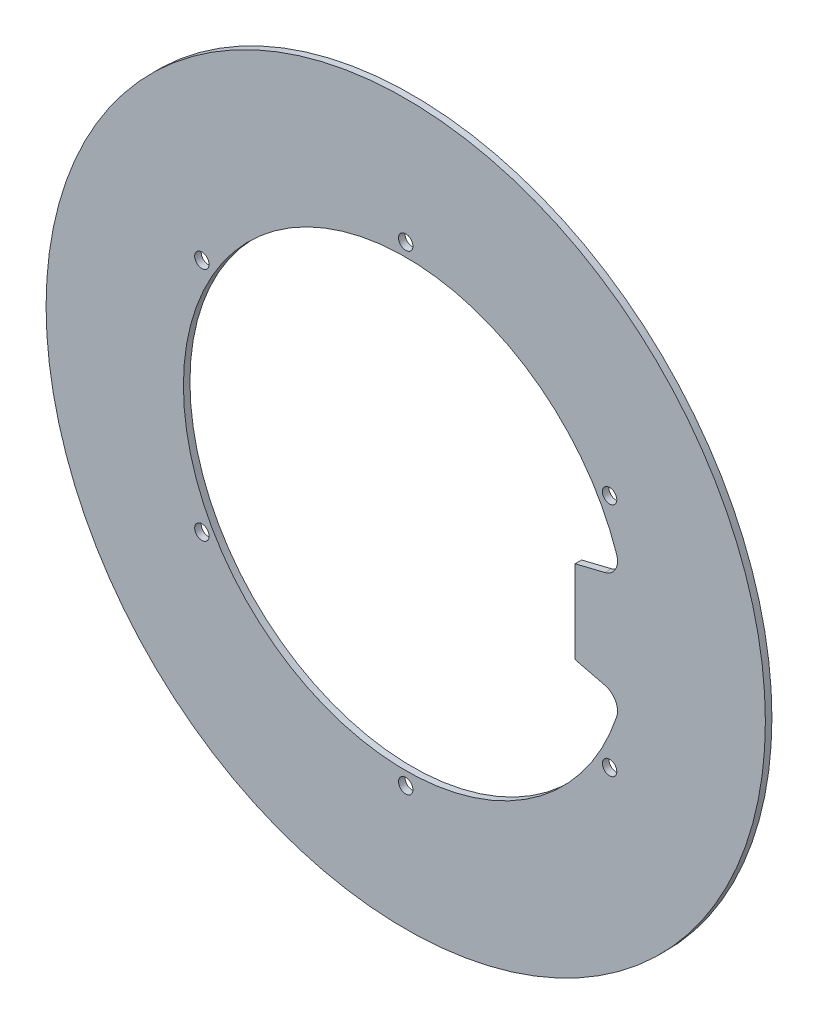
ISO-10303-21;
HEADER;
FILE_DESCRIPTION(('STEP AP214'),'2;1');
FILE_NAME('part.step','',(''),(''),'','','');
FILE_SCHEMA(('AUTOMOTIVE_DESIGN { 1 0 10303 214 1 1 1 1 }'));
ENDSEC;
DATA;
#1=APPLICATION_CONTEXT('core data for automotive mechanical design processes');
#2=APPLICATION_PROTOCOL_DEFINITION('international standard','automotive_design',2000,#1);
#3=PRODUCT_CONTEXT('',#1,'mechanical');
#4=PRODUCT('Part','Part','',(#3));
#5=PRODUCT_RELATED_PRODUCT_CATEGORY('part','',(#4));
#6=PRODUCT_DEFINITION_FORMATION('','',#4);
#7=PRODUCT_DEFINITION_CONTEXT('part definition',#1,'design');
#8=PRODUCT_DEFINITION('design','',#6,#7);
#9=PRODUCT_DEFINITION_SHAPE('','',#8);
#10=(LENGTH_UNIT() NAMED_UNIT(*) SI_UNIT(.MILLI.,.METRE.));
#11=(NAMED_UNIT(*) PLANE_ANGLE_UNIT() SI_UNIT($,.RADIAN.));
#12=(NAMED_UNIT(*) SI_UNIT($,.STERADIAN.) SOLID_ANGLE_UNIT());
#13=UNCERTAINTY_MEASURE_WITH_UNIT(LENGTH_MEASURE(1.E-05),#10,'distance_accuracy_value','');
#14=(GEOMETRIC_REPRESENTATION_CONTEXT(3) GLOBAL_UNCERTAINTY_ASSIGNED_CONTEXT((#13)) GLOBAL_UNIT_ASSIGNED_CONTEXT((#10,
#11,#12)) REPRESENTATION_CONTEXT('',''));
#15=CARTESIAN_POINT('',(0.,0.,0.));
#16=DIRECTION('',(0.,0.,1.));
#17=DIRECTION('',(1.,0.,0.));
#18=AXIS2_PLACEMENT_3D('',#15,#16,#17);
#19=CARTESIAN_POINT('',(0.,0.,1.));
#20=DIRECTION('',(0.,0.,1.));
#21=DIRECTION('',(1.,0.,0.));
#22=AXIS2_PLACEMENT_3D('',#19,#20,#21);
#23=PLANE('',#22);
#24=CARTESIAN_POINT('',(-31.1769145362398,-18.,1.));
#25=DIRECTION('',(0.,0.,1.));
#26=DIRECTION('',(1.,0.,0.));
#27=AXIS2_PLACEMENT_3D('',#24,#25,#26);
#28=CIRCLE('',#27,1.10000000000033);
#29=CARTESIAN_POINT('',(-30.0769145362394,-18.,1.));
#30=VERTEX_POINT('',#29);
#31=EDGE_CURVE('E143',#30,#30,#28,.T.);
#32=ORIENTED_EDGE('',*,*,#31,.F.);
#33=EDGE_LOOP('',(#32));
#34=FACE_BOUND('',#33,.T.);
#35=CARTESIAN_POINT('',(31.1769145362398,-18.,1.));
#36=DIRECTION('',(0.,0.,1.));
#37=DIRECTION('',(1.,0.,0.));
#38=AXIS2_PLACEMENT_3D('',#35,#36,#37);
#39=CIRCLE('',#38,1.10000000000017);
#40=CARTESIAN_POINT('',(32.27691453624,-18.,1.));
#41=VERTEX_POINT('',#40);
#42=EDGE_CURVE('E155',#41,#41,#39,.T.);
#43=ORIENTED_EDGE('',*,*,#42,.F.);
#44=EDGE_LOOP('',(#43));
#45=FACE_BOUND('',#44,.T.);
#46=CARTESIAN_POINT('',(0.,36.,1.));
#47=DIRECTION('',(0.,0.,1.));
#48=DIRECTION('',(1.,0.,0.));
#49=AXIS2_PLACEMENT_3D('',#46,#47,#48);
#50=CIRCLE('',#49,1.1);
#51=CARTESIAN_POINT('',(1.1,36.,1.));
#52=VERTEX_POINT('',#51);
#53=EDGE_CURVE('E167',#52,#52,#50,.T.);
#54=ORIENTED_EDGE('',*,*,#53,.F.);
#55=EDGE_LOOP('',(#54));
#56=FACE_BOUND('',#55,.T.);
#57=CARTESIAN_POINT('',(0.,0.,1.));
#58=DIRECTION('',(0.,0.,1.));
#59=DIRECTION('',(1.,0.,0.));
#60=AXIS2_PLACEMENT_3D('',#57,#58,#59);
#61=CIRCLE('',#60,55.);
#62=CARTESIAN_POINT('',(55.,0.,1.));
#63=VERTEX_POINT('',#62);
#64=EDGE_CURVE('E11',#63,#63,#61,.T.);
#65=ORIENTED_EDGE('',*,*,#64,.T.);
#66=EDGE_LOOP('',(#65));
#67=FACE_BOUND('',#66,.T.);
#68=CARTESIAN_POINT('',(31.1769145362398,17.9999999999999,1.));
#69=DIRECTION('',(0.,0.,1.));
#70=DIRECTION('',(1.,0.,0.));
#71=AXIS2_PLACEMENT_3D('',#68,#69,#70);
#72=CIRCLE('',#71,1.09999999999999);
#73=CARTESIAN_POINT('',(32.2769145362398,17.9999999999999,1.));
#74=VERTEX_POINT('',#73);
#75=EDGE_CURVE('E161',#74,#74,#72,.T.);
#76=ORIENTED_EDGE('',*,*,#75,.F.);
#77=EDGE_LOOP('',(#76));
#78=FACE_BOUND('',#77,.T.);
#79=CARTESIAN_POINT('',(0.,-36.,1.));
#80=DIRECTION('',(0.,0.,1.));
#81=DIRECTION('',(1.,0.,0.));
#82=AXIS2_PLACEMENT_3D('',#79,#80,#81);
#83=CIRCLE('',#82,1.10000000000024);
#84=CARTESIAN_POINT('',(1.10000000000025,-36.,1.));
#85=VERTEX_POINT('',#84);
#86=EDGE_CURVE('E149',#85,#85,#83,.T.);
#87=ORIENTED_EDGE('',*,*,#86,.F.);
#88=EDGE_LOOP('',(#87));
#89=FACE_BOUND('',#88,.T.);
#90=CARTESIAN_POINT('',(-31.1769145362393,17.9999999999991,1.));
#91=DIRECTION('',(0.,0.,1.));
#92=DIRECTION('',(1.,0.,0.));
#93=AXIS2_PLACEMENT_3D('',#90,#91,#92);
#94=CIRCLE('',#93,1.10000000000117);
#95=CARTESIAN_POINT('',(-30.0769145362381,17.9999999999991,1.));
#96=VERTEX_POINT('',#95);
#97=EDGE_CURVE('E137',#96,#96,#94,.T.);
#98=ORIENTED_EDGE('',*,*,#97,.F.);
#99=EDGE_LOOP('',(#98));
#100=FACE_BOUND('',#99,.T.);
#101=DIRECTION('',(0.971252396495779,0.238052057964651,0.));
#102=VECTOR('',#101,1.);
#103=CARTESIAN_POINT('',(25.908,6.35,1.));
#104=LINE('',#103,#102);
#105=CARTESIAN_POINT('',(25.908,6.35,1.));
#106=VERTEX_POINT('',#105);
#107=CARTESIAN_POINT('',(30.4558486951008,7.46466879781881,1.));
#108=VERTEX_POINT('',#107);
#109=EDGE_CURVE('E94',#106,#108,#104,.T.);
#110=ORIENTED_EDGE('',*,*,#109,.F.);
#111=DIRECTION('',(0.,1.,0.));
#112=VECTOR('',#111,1.);
#113=CARTESIAN_POINT('',(25.908,-6.35,1.));
#114=LINE('',#113,#112);
#115=CARTESIAN_POINT('',(25.908,-6.35,1.));
#116=VERTEX_POINT('',#115);
#117=EDGE_CURVE('E86',#116,#106,#114,.T.);
#118=ORIENTED_EDGE('',*,*,#117,.F.);
#119=DIRECTION('',(-0.971252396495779,0.238052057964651,0.));
#120=VECTOR('',#119,1.);
#121=CARTESIAN_POINT('',(25.908,-6.35,1.));
#122=LINE('',#121,#120);
#123=CARTESIAN_POINT('',(30.4558486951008,-7.46466879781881,1.));
#124=VERTEX_POINT('',#123);
#125=EDGE_CURVE('E115',#124,#116,#122,.T.);
#126=ORIENTED_EDGE('',*,*,#125,.F.);
#127=CARTESIAN_POINT('',(29.8511964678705,-9.93164988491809,1.));
#128=DIRECTION('',(0.,0.,1.));
#129=DIRECTION('',(-1.,0.,0.));
#130=AXIS2_PLACEMENT_3D('',#127,#128,#129);
#131=CIRCLE('',#130,2.54);
#132=CARTESIAN_POINT('',(32.2613057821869,-10.7335059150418,1.));
#133=VERTEX_POINT('',#132);
#134=EDGE_CURVE('E113',#133,#124,#131,.T.);
#135=ORIENTED_EDGE('',*,*,#134,.F.);
#136=CARTESIAN_POINT('',(0.,0.,1.));
#137=DIRECTION('',(0.,0.,1.));
#138=DIRECTION('',(1.,0.,0.));
#139=AXIS2_PLACEMENT_3D('',#136,#137,#138);
#140=CIRCLE('',#139,34.);
#141=CARTESIAN_POINT('',(32.2613057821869,10.7335059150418,1.));
#142=VERTEX_POINT('',#141);
#143=EDGE_CURVE('E109',#142,#133,#140,.T.);
#144=ORIENTED_EDGE('',*,*,#143,.F.);
#145=CARTESIAN_POINT('',(29.8511964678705,9.93164988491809,1.));
#146=DIRECTION('',(0.,0.,1.));
#147=DIRECTION('',(1.,0.,0.));
#148=AXIS2_PLACEMENT_3D('',#145,#146,#147);
#149=CIRCLE('',#148,2.54);
#150=EDGE_CURVE('E107',#108,#142,#149,.T.);
#151=ORIENTED_EDGE('',*,*,#150,.F.);
#152=EDGE_LOOP('',(#110,#118,#126,#135,#144,#151));
#153=FACE_BOUND('',#152,.T.);
#154=ADVANCED_FACE('F33',(#34,#45,#56,#67,#78,#89,#100,#153),#23,.T.);
#155=CARTESIAN_POINT('',(0.,0.,0.));
#156=DIRECTION('',(0.,0.,1.));
#157=DIRECTION('',(1.,0.,0.));
#158=AXIS2_PLACEMENT_3D('',#155,#156,#157);
#159=PLANE('',#158);
#160=CARTESIAN_POINT('',(-31.1769145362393,17.9999999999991,0.));
#161=DIRECTION('',(0.,0.,1.));
#162=DIRECTION('',(1.,0.,0.));
#163=AXIS2_PLACEMENT_3D('',#160,#161,#162);
#164=CIRCLE('',#163,1.10000000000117);
#165=CARTESIAN_POINT('',(-30.0769145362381,17.9999999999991,0.));
#166=VERTEX_POINT('',#165);
#167=EDGE_CURVE('E102',#166,#166,#164,.T.);
#168=ORIENTED_EDGE('',*,*,#167,.T.);
#169=EDGE_LOOP('',(#168));
#170=FACE_BOUND('',#169,.T.);
#171=CARTESIAN_POINT('',(-31.1769145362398,-18.,0.));
#172=DIRECTION('',(0.,0.,1.));
#173=DIRECTION('',(1.,0.,0.));
#174=AXIS2_PLACEMENT_3D('',#171,#172,#173);
#175=CIRCLE('',#174,1.10000000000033);
#176=CARTESIAN_POINT('',(-30.0769145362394,-18.,0.));
#177=VERTEX_POINT('',#176);
#178=EDGE_CURVE('E140',#177,#177,#175,.T.);
#179=ORIENTED_EDGE('',*,*,#178,.T.);
#180=EDGE_LOOP('',(#179));
#181=FACE_BOUND('',#180,.T.);
#182=CARTESIAN_POINT('',(0.,-36.,0.));
#183=DIRECTION('',(0.,0.,1.));
#184=DIRECTION('',(1.,0.,0.));
#185=AXIS2_PLACEMENT_3D('',#182,#183,#184);
#186=CIRCLE('',#185,1.10000000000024);
#187=CARTESIAN_POINT('',(1.10000000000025,-36.,0.));
#188=VERTEX_POINT('',#187);
#189=EDGE_CURVE('E146',#188,#188,#186,.T.);
#190=ORIENTED_EDGE('',*,*,#189,.T.);
#191=EDGE_LOOP('',(#190));
#192=FACE_BOUND('',#191,.T.);
#193=CARTESIAN_POINT('',(31.1769145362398,-18.,0.));
#194=DIRECTION('',(0.,0.,1.));
#195=DIRECTION('',(1.,0.,0.));
#196=AXIS2_PLACEMENT_3D('',#193,#194,#195);
#197=CIRCLE('',#196,1.10000000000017);
#198=CARTESIAN_POINT('',(32.27691453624,-18.,0.));
#199=VERTEX_POINT('',#198);
#200=EDGE_CURVE('E152',#199,#199,#197,.T.);
#201=ORIENTED_EDGE('',*,*,#200,.T.);
#202=EDGE_LOOP('',(#201));
#203=FACE_BOUND('',#202,.T.);
#204=CARTESIAN_POINT('',(31.1769145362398,17.9999999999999,0.));
#205=DIRECTION('',(0.,0.,1.));
#206=DIRECTION('',(1.,0.,0.));
#207=AXIS2_PLACEMENT_3D('',#204,#205,#206);
#208=CIRCLE('',#207,1.09999999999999);
#209=CARTESIAN_POINT('',(32.2769145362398,17.9999999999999,0.));
#210=VERTEX_POINT('',#209);
#211=EDGE_CURVE('E158',#210,#210,#208,.T.);
#212=ORIENTED_EDGE('',*,*,#211,.T.);
#213=EDGE_LOOP('',(#212));
#214=FACE_BOUND('',#213,.T.);
#215=CARTESIAN_POINT('',(0.,36.,0.));
#216=DIRECTION('',(0.,0.,1.));
#217=DIRECTION('',(1.,0.,0.));
#218=AXIS2_PLACEMENT_3D('',#215,#216,#217);
#219=CIRCLE('',#218,1.1);
#220=CARTESIAN_POINT('',(1.1,36.,0.));
#221=VERTEX_POINT('',#220);
#222=EDGE_CURVE('E164',#221,#221,#219,.T.);
#223=ORIENTED_EDGE('',*,*,#222,.T.);
#224=EDGE_LOOP('',(#223));
#225=FACE_BOUND('',#224,.T.);
#226=CARTESIAN_POINT('',(0.,0.,0.));
#227=DIRECTION('',(0.,0.,1.));
#228=DIRECTION('',(1.,0.,0.));
#229=AXIS2_PLACEMENT_3D('',#226,#227,#228);
#230=CIRCLE('',#229,55.);
#231=CARTESIAN_POINT('',(55.,0.,0.));
#232=VERTEX_POINT('',#231);
#233=EDGE_CURVE('E37',#232,#232,#230,.T.);
#234=ORIENTED_EDGE('',*,*,#233,.F.);
#235=EDGE_LOOP('',(#234));
#236=FACE_BOUND('',#235,.T.);
#237=DIRECTION('',(0.,1.,0.));
#238=VECTOR('',#237,1.);
#239=CARTESIAN_POINT('',(25.908,-6.35,0.));
#240=LINE('',#239,#238);
#241=CARTESIAN_POINT('',(25.908,-6.35,0.));
#242=VERTEX_POINT('',#241);
#243=CARTESIAN_POINT('',(25.908,6.35,0.));
#244=VERTEX_POINT('',#243);
#245=EDGE_CURVE('E56',#242,#244,#240,.T.);
#246=ORIENTED_EDGE('',*,*,#245,.T.);
#247=DIRECTION('',(0.971252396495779,0.238052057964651,0.));
#248=VECTOR('',#247,1.);
#249=CARTESIAN_POINT('',(25.908,6.35,0.));
#250=LINE('',#249,#248);
#251=CARTESIAN_POINT('',(30.4558486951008,7.46466879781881,0.));
#252=VERTEX_POINT('',#251);
#253=EDGE_CURVE('E101',#244,#252,#250,.T.);
#254=ORIENTED_EDGE('',*,*,#253,.T.);
#255=CARTESIAN_POINT('',(29.8511964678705,9.93164988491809,0.));
#256=DIRECTION('',(0.,0.,1.));
#257=DIRECTION('',(1.,0.,0.));
#258=AXIS2_PLACEMENT_3D('',#255,#256,#257);
#259=CIRCLE('',#258,2.54);
#260=CARTESIAN_POINT('',(32.2613057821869,10.7335059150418,0.));
#261=VERTEX_POINT('',#260);
#262=EDGE_CURVE('E119',#252,#261,#259,.T.);
#263=ORIENTED_EDGE('',*,*,#262,.T.);
#264=CARTESIAN_POINT('',(0.,0.,0.));
#265=DIRECTION('',(0.,0.,1.));
#266=DIRECTION('',(1.,0.,0.));
#267=AXIS2_PLACEMENT_3D('',#264,#265,#266);
#268=CIRCLE('',#267,34.);
#269=CARTESIAN_POINT('',(32.2613057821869,-10.7335059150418,0.));
#270=VERTEX_POINT('',#269);
#271=EDGE_CURVE('E122',#261,#270,#268,.T.);
#272=ORIENTED_EDGE('',*,*,#271,.T.);
#273=CARTESIAN_POINT('',(29.8511964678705,-9.93164988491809,0.));
#274=DIRECTION('',(0.,0.,1.));
#275=DIRECTION('',(-1.,0.,0.));
#276=AXIS2_PLACEMENT_3D('',#273,#274,#275);
#277=CIRCLE('',#276,2.54);
#278=CARTESIAN_POINT('',(30.4558486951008,-7.46466879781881,0.));
#279=VERTEX_POINT('',#278);
#280=EDGE_CURVE('E125',#270,#279,#277,.T.);
#281=ORIENTED_EDGE('',*,*,#280,.T.);
#282=DIRECTION('',(-0.971252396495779,0.238052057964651,0.));
#283=VECTOR('',#282,1.);
#284=CARTESIAN_POINT('',(25.908,-6.35,0.));
#285=LINE('',#284,#283);
#286=EDGE_CURVE('E95',#279,#242,#285,.T.);
#287=ORIENTED_EDGE('',*,*,#286,.T.);
#288=EDGE_LOOP('',(#246,#254,#263,#272,#281,#287));
#289=FACE_BOUND('',#288,.T.);
#290=ADVANCED_FACE('F173',(#170,#181,#192,#203,#214,#225,#236,#289),#159,.F.);
#291=CARTESIAN_POINT('',(0.,0.,1.));
#292=DIRECTION('',(0.,0.,-1.));
#293=DIRECTION('',(-1.,0.,0.));
#294=AXIS2_PLACEMENT_3D('',#291,#292,#293);
#295=CYLINDRICAL_SURFACE('',#294,55.);
#296=ORIENTED_EDGE('',*,*,#64,.F.);
#297=EDGE_LOOP('',(#296));
#298=FACE_BOUND('',#297,.T.);
#299=ORIENTED_EDGE('',*,*,#233,.T.);
#300=EDGE_LOOP('',(#299));
#301=FACE_BOUND('',#300,.T.);
#302=ADVANCED_FACE('F35',(#298,#301),#295,.T.);
#303=CARTESIAN_POINT('',(0.,36.,1.));
#304=DIRECTION('',(0.,0.,-1.));
#305=DIRECTION('',(-1.,0.,0.));
#306=AXIS2_PLACEMENT_3D('',#303,#304,#305);
#307=CYLINDRICAL_SURFACE('',#306,1.1);
#308=ORIENTED_EDGE('',*,*,#53,.T.);
#309=EDGE_LOOP('',(#308));
#310=FACE_BOUND('',#309,.T.);
#311=ORIENTED_EDGE('',*,*,#222,.F.);
#312=EDGE_LOOP('',(#311));
#313=FACE_BOUND('',#312,.T.);
#314=ADVANCED_FACE('F176',(#310,#313),#307,.F.);
#315=CARTESIAN_POINT('',(31.1769145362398,17.9999999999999,1.));
#316=DIRECTION('',(0.,0.,-1.));
#317=DIRECTION('',(-1.,0.,0.));
#318=AXIS2_PLACEMENT_3D('',#315,#316,#317);
#319=CYLINDRICAL_SURFACE('',#318,1.09999999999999);
#320=ORIENTED_EDGE('',*,*,#75,.T.);
#321=EDGE_LOOP('',(#320));
#322=FACE_BOUND('',#321,.T.);
#323=ORIENTED_EDGE('',*,*,#211,.F.);
#324=EDGE_LOOP('',(#323));
#325=FACE_BOUND('',#324,.T.);
#326=ADVANCED_FACE('F178',(#322,#325),#319,.F.);
#327=CARTESIAN_POINT('',(31.1769145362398,-18.,1.));
#328=DIRECTION('',(0.,0.,-1.));
#329=DIRECTION('',(-1.,0.,0.));
#330=AXIS2_PLACEMENT_3D('',#327,#328,#329);
#331=CYLINDRICAL_SURFACE('',#330,1.10000000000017);
#332=ORIENTED_EDGE('',*,*,#42,.T.);
#333=EDGE_LOOP('',(#332));
#334=FACE_BOUND('',#333,.T.);
#335=ORIENTED_EDGE('',*,*,#200,.F.);
#336=EDGE_LOOP('',(#335));
#337=FACE_BOUND('',#336,.T.);
#338=ADVANCED_FACE('F185',(#334,#337),#331,.F.);
#339=CARTESIAN_POINT('',(0.,-36.,1.));
#340=DIRECTION('',(0.,0.,-1.));
#341=DIRECTION('',(-1.,0.,0.));
#342=AXIS2_PLACEMENT_3D('',#339,#340,#341);
#343=CYLINDRICAL_SURFACE('',#342,1.10000000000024);
#344=ORIENTED_EDGE('',*,*,#86,.T.);
#345=EDGE_LOOP('',(#344));
#346=FACE_BOUND('',#345,.T.);
#347=ORIENTED_EDGE('',*,*,#189,.F.);
#348=EDGE_LOOP('',(#347));
#349=FACE_BOUND('',#348,.T.);
#350=ADVANCED_FACE('F227',(#346,#349),#343,.F.);
#351=CARTESIAN_POINT('',(-31.1769145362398,-18.,1.));
#352=DIRECTION('',(0.,0.,-1.));
#353=DIRECTION('',(-1.,0.,0.));
#354=AXIS2_PLACEMENT_3D('',#351,#352,#353);
#355=CYLINDRICAL_SURFACE('',#354,1.10000000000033);
#356=ORIENTED_EDGE('',*,*,#31,.T.);
#357=EDGE_LOOP('',(#356));
#358=FACE_BOUND('',#357,.T.);
#359=ORIENTED_EDGE('',*,*,#178,.F.);
#360=EDGE_LOOP('',(#359));
#361=FACE_BOUND('',#360,.T.);
#362=ADVANCED_FACE('F213',(#358,#361),#355,.F.);
#363=CARTESIAN_POINT('',(-31.1769145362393,17.9999999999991,1.));
#364=DIRECTION('',(0.,0.,-1.));
#365=DIRECTION('',(-1.,0.,0.));
#366=AXIS2_PLACEMENT_3D('',#363,#364,#365);
#367=CYLINDRICAL_SURFACE('',#366,1.10000000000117);
#368=ORIENTED_EDGE('',*,*,#97,.T.);
#369=EDGE_LOOP('',(#368));
#370=FACE_BOUND('',#369,.T.);
#371=ORIENTED_EDGE('',*,*,#167,.F.);
#372=EDGE_LOOP('',(#371));
#373=FACE_BOUND('',#372,.T.);
#374=ADVANCED_FACE('F210',(#370,#373),#367,.F.);
#375=CARTESIAN_POINT('',(25.908,-6.35,1.));
#376=DIRECTION('',(-1.,0.,0.));
#377=DIRECTION('',(0.,0.,1.));
#378=AXIS2_PLACEMENT_3D('',#375,#376,#377);
#379=PLANE('',#378);
#380=ORIENTED_EDGE('',*,*,#245,.F.);
#381=DIRECTION('',(0.,0.,-1.));
#382=VECTOR('',#381,1.);
#383=CARTESIAN_POINT('',(25.908,-6.35,1.));
#384=LINE('',#383,#382);
#385=EDGE_CURVE('E90',#116,#242,#384,.T.);
#386=ORIENTED_EDGE('',*,*,#385,.F.);
#387=ORIENTED_EDGE('',*,*,#117,.T.);
#388=DIRECTION('',(0.,0.,-1.));
#389=VECTOR('',#388,1.);
#390=CARTESIAN_POINT('',(25.908,6.35,1.));
#391=LINE('',#390,#389);
#392=EDGE_CURVE('E89',#106,#244,#391,.T.);
#393=ORIENTED_EDGE('',*,*,#392,.T.);
#394=EDGE_LOOP('',(#380,#386,#387,#393));
#395=FACE_BOUND('',#394,.T.);
#396=ADVANCED_FACE('F88',(#395),#379,.T.);
#397=CARTESIAN_POINT('',(25.908,6.35,1.));
#398=DIRECTION('',(-0.238052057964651,0.971252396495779,0.));
#399=DIRECTION('',(-0.971252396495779,-0.238052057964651,0.));
#400=AXIS2_PLACEMENT_3D('',#397,#398,#399);
#401=PLANE('',#400);
#402=ORIENTED_EDGE('',*,*,#253,.F.);
#403=ORIENTED_EDGE('',*,*,#392,.F.);
#404=ORIENTED_EDGE('',*,*,#109,.T.);
#405=DIRECTION('',(0.,0.,-1.));
#406=VECTOR('',#405,1.);
#407=CARTESIAN_POINT('',(30.4558486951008,7.46466879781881,1.));
#408=LINE('',#407,#406);
#409=EDGE_CURVE('E103',#108,#252,#408,.T.);
#410=ORIENTED_EDGE('',*,*,#409,.T.);
#411=EDGE_LOOP('',(#402,#403,#404,#410));
#412=FACE_BOUND('',#411,.T.);
#413=ADVANCED_FACE('F98',(#412),#401,.T.);
#414=CARTESIAN_POINT('',(29.8511964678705,9.93164988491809,1.));
#415=DIRECTION('',(0.,0.,-1.));
#416=DIRECTION('',(-1.,0.,0.));
#417=AXIS2_PLACEMENT_3D('',#414,#415,#416);
#418=CYLINDRICAL_SURFACE('',#417,2.54);
#419=ORIENTED_EDGE('',*,*,#262,.F.);
#420=ORIENTED_EDGE('',*,*,#409,.F.);
#421=ORIENTED_EDGE('',*,*,#150,.T.);
#422=DIRECTION('',(0.,0.,-1.));
#423=VECTOR('',#422,1.);
#424=CARTESIAN_POINT('',(32.2613057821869,10.7335059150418,1.));
#425=LINE('',#424,#423);
#426=EDGE_CURVE('E134',#142,#261,#425,.T.);
#427=ORIENTED_EDGE('',*,*,#426,.T.);
#428=EDGE_LOOP('',(#419,#420,#421,#427));
#429=FACE_BOUND('',#428,.T.);
#430=ADVANCED_FACE('F243',(#429),#418,.F.);
#431=CARTESIAN_POINT('',(0.,0.,1.));
#432=DIRECTION('',(0.,0.,-1.));
#433=DIRECTION('',(-1.,0.,0.));
#434=AXIS2_PLACEMENT_3D('',#431,#432,#433);
#435=CYLINDRICAL_SURFACE('',#434,34.);
#436=ORIENTED_EDGE('',*,*,#271,.F.);
#437=ORIENTED_EDGE('',*,*,#426,.F.);
#438=ORIENTED_EDGE('',*,*,#143,.T.);
#439=DIRECTION('',(0.,0.,-1.));
#440=VECTOR('',#439,1.);
#441=CARTESIAN_POINT('',(32.2613057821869,-10.7335059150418,1.));
#442=LINE('',#441,#440);
#443=EDGE_CURVE('E132',#133,#270,#442,.T.);
#444=ORIENTED_EDGE('',*,*,#443,.T.);
#445=EDGE_LOOP('',(#436,#437,#438,#444));
#446=FACE_BOUND('',#445,.T.);
#447=ADVANCED_FACE('F246',(#446),#435,.F.);
#448=CARTESIAN_POINT('',(29.8511964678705,-9.93164988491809,1.));
#449=DIRECTION('',(0.,0.,-1.));
#450=DIRECTION('',(-1.,0.,0.));
#451=AXIS2_PLACEMENT_3D('',#448,#449,#450);
#452=CYLINDRICAL_SURFACE('',#451,2.54);
#453=ORIENTED_EDGE('',*,*,#280,.F.);
#454=ORIENTED_EDGE('',*,*,#443,.F.);
#455=ORIENTED_EDGE('',*,*,#134,.T.);
#456=DIRECTION('',(0.,0.,-1.));
#457=VECTOR('',#456,1.);
#458=CARTESIAN_POINT('',(30.4558486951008,-7.46466879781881,1.));
#459=LINE('',#458,#457);
#460=EDGE_CURVE('E48',#124,#279,#459,.T.);
#461=ORIENTED_EDGE('',*,*,#460,.T.);
#462=EDGE_LOOP('',(#453,#454,#455,#461));
#463=FACE_BOUND('',#462,.T.);
#464=ADVANCED_FACE('F250',(#463),#452,.F.);
#465=CARTESIAN_POINT('',(25.908,-6.35,1.));
#466=DIRECTION('',(-0.238052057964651,-0.971252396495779,0.));
#467=DIRECTION('',(0.971252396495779,-0.238052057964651,0.));
#468=AXIS2_PLACEMENT_3D('',#465,#466,#467);
#469=PLANE('',#468);
#470=ORIENTED_EDGE('',*,*,#286,.F.);
#471=ORIENTED_EDGE('',*,*,#460,.F.);
#472=ORIENTED_EDGE('',*,*,#125,.T.);
#473=ORIENTED_EDGE('',*,*,#385,.T.);
#474=EDGE_LOOP('',(#470,#471,#472,#473));
#475=FACE_BOUND('',#474,.T.);
#476=ADVANCED_FACE('F254',(#475),#469,.T.);
#477=CLOSED_SHELL('',(#154,#290,#302,#314,#326,#338,#350,#362,#374,#396,#413,#430,#447,#464,#476));
#478=MANIFOLD_SOLID_BREP('B2',#477);
#479=ADVANCED_BREP_SHAPE_REPRESENTATION('',(#18,#478),#14);
#480=SHAPE_DEFINITION_REPRESENTATION(#9,#479);
ENDSEC;
END-ISO-10303-21;
